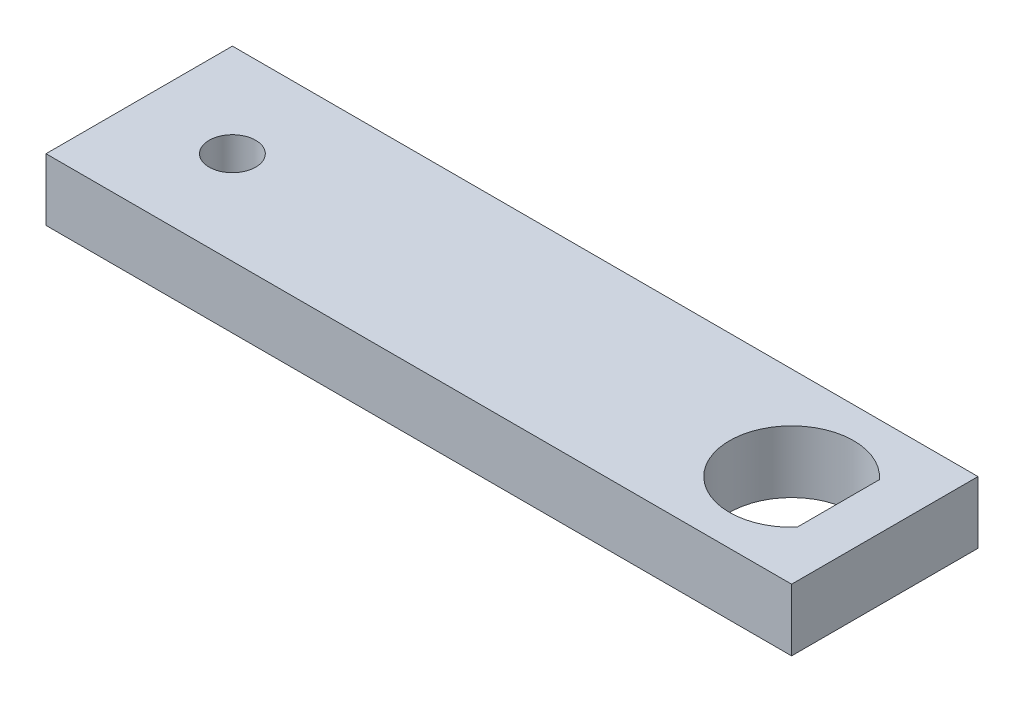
from build123d import *

# Parameters (mm, degrees)
SKETCH1_W          = 76.2
SKETCH1_H          = 6.35
BASE_EXTRUDE_DEPTH = 19.05
CUT_EXTRUDE1_DEPTH = 79.801427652
SKETCH3_R          = 2.38125
CUT_EXTRUDE2_DEPTH = 79.801427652


with BuildPart() as part:
    # Sketch1 → Base-Extrude (new body)
    with BuildSketch(Plane.XY):
        with Locations((38.1, 3.175)):
            Rectangle(SKETCH1_W, SKETCH1_H)
    extrude(amount=BASE_EXTRUDE_DEPTH)

    # Sketch2 → Cut-Extrude1 (cut, through all)
    with BuildSketch(Plane(origin=(0, 6.35, 0), x_dir=(-1, 0, 0), z_dir=(0, 1, 0))):
        with BuildLine():
            Line((-71.4375, 5.324869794), (-71.4375, 13.725130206))
            ThreePointArc((-71.4375, 13.725130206), (-60.325, 9.525), (-71.4375, 5.324869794))
        make_face()
    extrude(amount=-CUT_EXTRUDE1_DEPTH, mode=Mode.SUBTRACT)

    # Sketch3 → Cut-Extrude2 (cut, through all)
    with BuildSketch(Plane(origin=(0, 6.35, 0), x_dir=(-1, 0, 0), z_dir=(0, 1, 0))):
        with Locations((-9.525, 9.525)):
            Circle(SKETCH3_R)
    extrude(amount=-CUT_EXTRUDE2_DEPTH, mode=Mode.SUBTRACT)


solid = part.part
